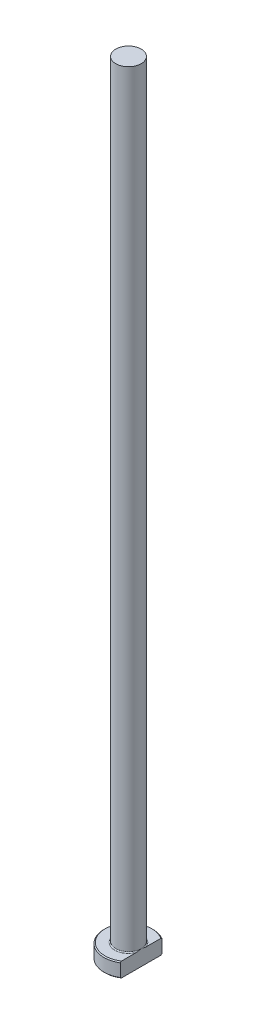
ISO-10303-21;
HEADER;
FILE_DESCRIPTION(('STEP AP214'),'2;1');
FILE_NAME('part.step','',(''),(''),'','','');
FILE_SCHEMA(('AUTOMOTIVE_DESIGN { 1 0 10303 214 1 1 1 1 }'));
ENDSEC;
DATA;
#1=APPLICATION_CONTEXT('core data for automotive mechanical design processes');
#2=APPLICATION_PROTOCOL_DEFINITION('international standard','automotive_design',2000,#1);
#3=PRODUCT_CONTEXT('',#1,'mechanical');
#4=PRODUCT('Part','Part','',(#3));
#5=PRODUCT_RELATED_PRODUCT_CATEGORY('part','',(#4));
#6=PRODUCT_DEFINITION_FORMATION('','',#4);
#7=PRODUCT_DEFINITION_CONTEXT('part definition',#1,'design');
#8=PRODUCT_DEFINITION('design','',#6,#7);
#9=PRODUCT_DEFINITION_SHAPE('','',#8);
#10=(LENGTH_UNIT() NAMED_UNIT(*) SI_UNIT(.MILLI.,.METRE.));
#11=(NAMED_UNIT(*) PLANE_ANGLE_UNIT() SI_UNIT($,.RADIAN.));
#12=(NAMED_UNIT(*) SI_UNIT($,.STERADIAN.) SOLID_ANGLE_UNIT());
#13=UNCERTAINTY_MEASURE_WITH_UNIT(LENGTH_MEASURE(1.E-05),#10,'distance_accuracy_value','');
#14=(GEOMETRIC_REPRESENTATION_CONTEXT(3) GLOBAL_UNCERTAINTY_ASSIGNED_CONTEXT((#13)) GLOBAL_UNIT_ASSIGNED_CONTEXT((#10,
#11,#12)) REPRESENTATION_CONTEXT('',''));
#15=CARTESIAN_POINT('',(0.,0.,0.));
#16=DIRECTION('',(0.,0.,1.));
#17=DIRECTION('',(1.,0.,0.));
#18=AXIS2_PLACEMENT_3D('',#15,#16,#17);
#19=CARTESIAN_POINT('',(0.,0.,0.));
#20=DIRECTION('',(0.,-1.,0.));
#21=DIRECTION('',(0.,0.,-1.));
#22=AXIS2_PLACEMENT_3D('',#19,#20,#21);
#23=PLANE('',#22);
#24=CARTESIAN_POINT('',(0.,0.,0.));
#25=DIRECTION('',(0.,-1.,0.));
#26=DIRECTION('',(0.,0.,-1.));
#27=AXIS2_PLACEMENT_3D('',#24,#25,#26);
#28=CIRCLE('',#27,4.79999999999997);
#29=CARTESIAN_POINT('',(2.59999999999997,0.,4.03484820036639));
#30=VERTEX_POINT('',#29);
#31=CARTESIAN_POINT('',(2.59999999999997,0.,-4.03484820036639));
#32=VERTEX_POINT('',#31);
#33=EDGE_CURVE('E98',#30,#32,#28,.T.);
#34=ORIENTED_EDGE('',*,*,#33,.T.);
#35=DIRECTION('',(0.,0.,1.));
#36=VECTOR('',#35,1.);
#37=CARTESIAN_POINT('',(2.59999999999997,0.,-4.27083130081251));
#38=LINE('',#37,#36);
#39=EDGE_CURVE('E83',#32,#30,#38,.T.);
#40=ORIENTED_EDGE('',*,*,#39,.T.);
#41=EDGE_LOOP('',(#34,#40));
#42=FACE_BOUND('',#41,.T.);
#43=ADVANCED_FACE('F32',(#42),#23,.T.);
#44=CARTESIAN_POINT('',(0.,259.958771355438,0.));
#45=DIRECTION('',(0.,1.,0.));
#46=DIRECTION('',(0.,0.,1.));
#47=AXIS2_PLACEMENT_3D('',#44,#45,#46);
#48=CYLINDRICAL_SURFACE('',#47,4.99999999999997);
#49=CARTESIAN_POINT('',(0.,2.80000000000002,0.));
#50=DIRECTION('',(0.,1.,0.));
#51=DIRECTION('',(0.,0.,1.));
#52=AXIS2_PLACEMENT_3D('',#49,#50,#51);
#53=CIRCLE('',#52,4.99999999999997);
#54=CARTESIAN_POINT('',(2.59999999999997,2.80000000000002,4.27083130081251));
#55=VERTEX_POINT('',#54);
#56=CARTESIAN_POINT('',(2.59999999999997,2.80000000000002,-4.27083130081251));
#57=VERTEX_POINT('',#56);
#58=EDGE_CURVE('E104',#55,#57,#53,.F.);
#59=ORIENTED_EDGE('',*,*,#58,.T.);
#60=DIRECTION('',(0.,-1.,0.));
#61=VECTOR('',#60,1.);
#62=CARTESIAN_POINT('',(2.59999999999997,160.,-4.27083130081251));
#63=LINE('',#62,#61);
#64=CARTESIAN_POINT('',(2.59999999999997,0.199999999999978,-4.27083130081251));
#65=VERTEX_POINT('',#64);
#66=EDGE_CURVE('E183',#57,#65,#63,.T.);
#67=ORIENTED_EDGE('',*,*,#66,.T.);
#68=CARTESIAN_POINT('',(0.,0.199999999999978,0.));
#69=DIRECTION('',(0.,-1.,0.));
#70=DIRECTION('',(0.,0.,-1.));
#71=AXIS2_PLACEMENT_3D('',#68,#69,#70);
#72=CIRCLE('',#71,4.99999999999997);
#73=CARTESIAN_POINT('',(2.59999999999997,0.199999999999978,4.27083130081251));
#74=VERTEX_POINT('',#73);
#75=EDGE_CURVE('E100',#65,#74,#72,.F.);
#76=ORIENTED_EDGE('',*,*,#75,.T.);
#77=DIRECTION('',(0.,-1.,0.));
#78=VECTOR('',#77,1.);
#79=CARTESIAN_POINT('',(2.59999999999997,160.,4.27083130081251));
#80=LINE('',#79,#78);
#81=EDGE_CURVE('E93',#55,#74,#80,.T.);
#82=ORIENTED_EDGE('',*,*,#81,.F.);
#83=EDGE_LOOP('',(#59,#67,#76,#82));
#84=FACE_BOUND('',#83,.T.);
#85=ADVANCED_FACE('F158',(#84),#48,.T.);
#86=CARTESIAN_POINT('',(-4.99999999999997,3.,0.));
#87=DIRECTION('',(0.,1.,0.));
#88=DIRECTION('',(0.,0.,1.));
#89=AXIS2_PLACEMENT_3D('',#86,#87,#88);
#90=PLANE('',#89);
#91=CARTESIAN_POINT('',(0.,3.,0.));
#92=DIRECTION('',(0.,1.,0.));
#93=DIRECTION('',(0.,0.,1.));
#94=AXIS2_PLACEMENT_3D('',#91,#92,#93);
#95=CIRCLE('',#94,4.80000000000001);
#96=CARTESIAN_POINT('',(2.59999999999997,3.,-4.03484820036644));
#97=VERTEX_POINT('',#96);
#98=CARTESIAN_POINT('',(2.59999999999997,3.,4.03484820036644));
#99=VERTEX_POINT('',#98);
#100=EDGE_CURVE('E178',#97,#99,#95,.T.);
#101=ORIENTED_EDGE('',*,*,#100,.T.);
#102=DIRECTION('',(0.,0.,-1.));
#103=VECTOR('',#102,1.);
#104=CARTESIAN_POINT('',(2.59999999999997,3.,0.));
#105=LINE('',#104,#103);
#106=CARTESIAN_POINT('',(2.59999999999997,2.99999999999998,1.03923048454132));
#107=VERTEX_POINT('',#106);
#108=EDGE_CURVE('E57',#99,#107,#105,.T.);
#109=ORIENTED_EDGE('',*,*,#108,.T.);
#110=CARTESIAN_POINT('',(0.,3.,0.));
#111=DIRECTION('',(0.,1.,0.));
#112=DIRECTION('',(0.,0.,1.));
#113=AXIS2_PLACEMENT_3D('',#110,#111,#112);
#114=CIRCLE('',#113,2.79999999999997);
#115=CARTESIAN_POINT('',(2.59999999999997,2.99999999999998,-1.03923048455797));
#116=VERTEX_POINT('',#115);
#117=EDGE_CURVE('E107',#107,#116,#114,.F.);
#118=ORIENTED_EDGE('',*,*,#117,.T.);
#119=EDGE_CURVE('E136',#116,#97,#105,.T.);
#120=ORIENTED_EDGE('',*,*,#119,.T.);
#121=EDGE_LOOP('',(#101,#109,#118,#120));
#122=FACE_BOUND('',#121,.T.);
#123=ADVANCED_FACE('F147',(#122),#90,.T.);
#124=CARTESIAN_POINT('',(0.,3.,0.));
#125=DIRECTION('',(0.,-1.,0.));
#126=DIRECTION('',(0.,0.,-1.));
#127=AXIS2_PLACEMENT_3D('',#124,#125,#126);
#128=CONICAL_SURFACE('',#127,4.80000000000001,0.785398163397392);
#129=ORIENTED_EDGE('',*,*,#58,.F.);
#130=CARTESIAN_POINT('',(2.59999999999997,-1.95047472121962,9.397433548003));
#131=CARTESIAN_POINT('',(2.59999999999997,-1.76015203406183,9.19995130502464));
#132=CARTESIAN_POINT('',(2.59999999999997,-1.57004107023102,9.00226440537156));
#133=CARTESIAN_POINT('',(2.59999999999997,-1.19035454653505,8.6063734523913));
#134=CARTESIAN_POINT('',(2.59999999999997,-1.00077899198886,8.40816939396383));
#135=CARTESIAN_POINT('',(2.59999999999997,-0.622208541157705,8.01106626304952));
#136=CARTESIAN_POINT('',(2.59999999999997,-0.433213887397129,7.81216695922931));
#137=CARTESIAN_POINT('',(2.59999999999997,-0.0560371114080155,7.41360059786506));
#138=CARTESIAN_POINT('',(2.59999999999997,0.132145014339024,7.21393354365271));
#139=CARTESIAN_POINT('',(2.59999999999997,0.504316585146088,6.81701377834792));
#140=CARTESIAN_POINT('',(2.59999999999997,0.68832319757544,6.61977717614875));
#141=CARTESIAN_POINT('',(2.59999999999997,1.05506202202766,6.22412305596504));
#142=CARTESIAN_POINT('',(2.59999999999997,1.23779424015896,6.0257055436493));
#143=CARTESIAN_POINT('',(2.59999999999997,1.60155525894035,5.62737135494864));
#144=CARTESIAN_POINT('',(2.59999999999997,1.78258432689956,5.42745492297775));
#145=CARTESIAN_POINT('',(2.59999999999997,2.14238277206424,5.02560172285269));
#146=CARTESIAN_POINT('',(2.59999999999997,2.32115220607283,4.82366500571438));
#147=CARTESIAN_POINT('',(2.59999999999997,2.62527031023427,4.47469662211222));
#148=CARTESIAN_POINT('',(2.59999999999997,2.75138938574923,4.3283372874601));
#149=CARTESIAN_POINT('',(2.59999999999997,3.00151582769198,4.03379615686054));
#150=CARTESIAN_POINT('',(2.59999999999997,3.12552298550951,3.88561418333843));
#151=CARTESIAN_POINT('',(2.59999999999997,3.37190002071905,3.58545728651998));
#152=CARTESIAN_POINT('',(2.59999999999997,3.49424212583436,3.43345946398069));
#153=CARTESIAN_POINT('',(2.59999999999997,3.73490070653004,3.12636139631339));
#154=CARTESIAN_POINT('',(2.59999999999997,3.85321820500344,2.97126195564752));
#155=CARTESIAN_POINT('',(2.59999999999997,4.08579009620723,2.65464223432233));
#156=CARTESIAN_POINT('',(2.59999999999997,4.19996477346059,2.49306256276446));
#157=CARTESIAN_POINT('',(2.59999999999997,4.36468341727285,2.2461359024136));
#158=CARTESIAN_POINT('',(2.59999999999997,4.41853818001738,2.16300143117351));
#159=CARTESIAN_POINT('',(2.59999999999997,4.52346182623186,1.99499855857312));
#160=CARTESIAN_POINT('',(2.59999999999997,4.57453099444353,1.91013033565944));
#161=CARTESIAN_POINT('',(2.59999999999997,4.67263274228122,1.73932569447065));
#162=CARTESIAN_POINT('',(2.59999999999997,4.71970407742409,1.65341183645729));
#163=CARTESIAN_POINT('',(2.59999999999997,4.80952240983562,1.4793650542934));
#164=CARTESIAN_POINT('',(2.59999999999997,4.85226857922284,1.39123170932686));
#165=CARTESIAN_POINT('',(2.59999999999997,4.97211006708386,1.12354274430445));
#166=CARTESIAN_POINT('',(2.59999999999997,5.04118725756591,0.940070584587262));
#167=CARTESIAN_POINT('',(2.59999999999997,5.11752261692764,0.665284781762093));
#168=CARTESIAN_POINT('',(2.59999999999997,5.13802992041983,0.577624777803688));
#169=CARTESIAN_POINT('',(2.59999999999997,5.17073291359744,0.400736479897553));
#170=CARTESIAN_POINT('',(2.59999999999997,5.18292955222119,0.311508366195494));
#171=CARTESIAN_POINT('',(2.59999999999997,5.19813789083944,0.132628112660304));
#172=CARTESIAN_POINT('',(2.59999999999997,5.20118701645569,0.0429792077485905));
#173=CARTESIAN_POINT('',(2.59999999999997,5.19797827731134,-0.136154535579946));
#174=CARTESIAN_POINT('',(2.59999999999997,5.19171987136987,-0.225639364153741));
#175=CARTESIAN_POINT('',(2.59999999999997,5.17043196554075,-0.402893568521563));
#176=CARTESIAN_POINT('',(2.59999999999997,5.15546490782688,-0.490670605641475));
#177=CARTESIAN_POINT('',(2.59999999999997,5.11776551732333,-0.664523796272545));
#178=CARTESIAN_POINT('',(2.59999999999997,5.09503206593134,-0.750599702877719));
#179=CARTESIAN_POINT('',(2.59999999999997,5.04281440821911,-0.921261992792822));
#180=CARTESIAN_POINT('',(2.59999999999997,5.01328729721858,-1.00583506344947));
#181=CARTESIAN_POINT('',(2.59999999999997,4.94875799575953,-1.17281894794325));
#182=CARTESIAN_POINT('',(2.59999999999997,4.91375683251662,-1.25523016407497));
#183=CARTESIAN_POINT('',(2.59999999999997,4.80599778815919,-1.49096020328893));
#184=CARTESIAN_POINT('',(2.59999999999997,4.72750956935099,-1.64165062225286));
#185=CARTESIAN_POINT('',(2.59999999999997,4.55999715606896,-1.93711610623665));
#186=CARTESIAN_POINT('',(2.59999999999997,4.47096030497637,-2.08188377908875));
#187=CARTESIAN_POINT('',(2.59999999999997,4.2854154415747,-2.36729512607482));
#188=CARTESIAN_POINT('',(2.59999999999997,4.18888021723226,-2.50792095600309));
#189=CARTESIAN_POINT('',(2.59999999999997,3.99085344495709,-2.78550445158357));
#190=CARTESIAN_POINT('',(2.59999999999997,3.88936425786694,-2.92246381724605));
#191=CARTESIAN_POINT('',(2.59999999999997,3.68147097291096,-3.19533708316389));
#192=CARTESIAN_POINT('',(2.59999999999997,3.57502092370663,-3.33121580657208));
#193=CARTESIAN_POINT('',(2.59999999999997,3.35937457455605,-3.60078977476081));
#194=CARTESIAN_POINT('',(2.59999999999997,3.25017800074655,-3.73448479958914));
#195=CARTESIAN_POINT('',(2.59999999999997,3.02996614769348,-3.9998356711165));
#196=CARTESIAN_POINT('',(2.59999999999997,2.91895572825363,-4.13149556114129));
#197=CARTESIAN_POINT('',(2.59999999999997,2.69532568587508,-4.39344289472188));
#198=CARTESIAN_POINT('',(2.59999999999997,2.5827060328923,-4.52373031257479));
#199=CARTESIAN_POINT('',(2.59999999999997,2.2882388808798,-4.86104966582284));
#200=CARTESIAN_POINT('',(2.59999999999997,2.1054031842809,-5.06721827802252));
#201=CARTESIAN_POINT('',(2.59999999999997,1.73743041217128,-5.47749422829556));
#202=CARTESIAN_POINT('',(2.59999999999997,1.55229327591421,-5.68160151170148));
#203=CARTESIAN_POINT('',(2.59999999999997,1.18015264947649,-6.08844300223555));
#204=CARTESIAN_POINT('',(2.59999999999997,0.993147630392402,-6.29117580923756));
#205=CARTESIAN_POINT('',(2.59999999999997,0.617846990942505,-6.69544313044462));
#206=CARTESIAN_POINT('',(2.59999999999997,0.429551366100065,-6.8969776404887));
#207=CARTESIAN_POINT('',(2.59999999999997,0.0594707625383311,-7.29110398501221));
#208=CARTESIAN_POINT('',(2.59999999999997,-0.122275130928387,-7.48373254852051));
#209=CARTESIAN_POINT('',(2.59999999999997,-0.486506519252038,-7.86829020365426));
#210=CARTESIAN_POINT('',(2.59999999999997,-0.668992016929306,-8.06021929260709));
#211=CARTESIAN_POINT('',(2.59999999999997,-1.03436396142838,-8.44329936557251));
#212=CARTESIAN_POINT('',(2.59999999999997,-1.21724976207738,-8.63445096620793));
#213=CARTESIAN_POINT('',(2.59999999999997,-1.58351605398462,-9.01627657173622));
#214=CARTESIAN_POINT('',(2.59999999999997,-1.7668965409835,-9.20695058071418));
#215=CARTESIAN_POINT('',(2.59999999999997,-1.95047472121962,-9.397433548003));
#216=B_SPLINE_CURVE_WITH_KNOTS('',3,(#130,#131,#132,#133,#134,#135,#136,#137,#138,#139,#140,
#141,#142,#143,#144,#145,#146,#147,#148,#149,#150,#151,#152,#153,#154,#155,#156,#157,#158,#159,
#160,#161,#162,#163,#164,#165,#166,#167,#168,#169,#170,#171,#172,#173,#174,#175,#176,#177,#178,
#179,#180,#181,#182,#183,#184,#185,#186,#187,#188,#189,#190,#191,#192,#193,#194,#195,#196,#197,
#198,#199,#200,#201,#202,#203,#204,#205,#206,#207,#208,#209,#210,#211,#212,#213,#214,#215),
.UNSPECIFIED.,.F.,.F.,(4,2,2,2,2,2,2,2,2,2,2,2,2,2,2,2,2,2,2,2,2,2,2,2,2,2,2,2,2,2,2,2,2,2,2,2,
2,2,2,2,2,2,4),(0.,0.822799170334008,1.6456064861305,2.46872021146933,3.29183036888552,
4.1010519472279,4.91026964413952,5.71935814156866,6.5284262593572,7.10801764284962,
7.68766594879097,8.27296873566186,8.85812163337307,9.4514382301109,9.74855643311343,
10.0456442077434,10.3394095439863,10.6332310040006,11.2186835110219,11.4884410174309,
11.7581677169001,12.0267893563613,12.2954266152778,12.5621610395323,12.828933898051,
13.0974401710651,13.3658961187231,13.874890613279,14.3845021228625,14.8960582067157,
15.4073728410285,15.9251595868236,16.4429981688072,16.9596236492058,17.4762587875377,
18.30291760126,19.129598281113,19.957022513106,20.7844496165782,21.5789508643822,
22.3734551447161,23.1671010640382,23.9607401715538),.UNSPECIFIED.);
#217=EDGE_CURVE('E135',#55,#99,#216,.T.);
#218=ORIENTED_EDGE('',*,*,#217,.T.);
#219=ORIENTED_EDGE('',*,*,#100,.F.);
#220=EDGE_CURVE('E127',#97,#57,#216,.T.);
#221=ORIENTED_EDGE('',*,*,#220,.T.);
#222=EDGE_LOOP('',(#129,#218,#219,#221));
#223=FACE_BOUND('',#222,.T.);
#224=ADVANCED_FACE('F143',(#223),#128,.T.);
#225=CARTESIAN_POINT('',(0.,0.199999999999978,0.));
#226=DIRECTION('',(0.,1.,0.));
#227=DIRECTION('',(0.,0.,1.));
#228=AXIS2_PLACEMENT_3D('',#225,#226,#227);
#229=CONICAL_SURFACE('',#228,4.99999999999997,0.785398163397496);
#230=ORIENTED_EDGE('',*,*,#75,.F.);
#231=CARTESIAN_POINT('',(2.59999999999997,4.95047472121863,-9.397433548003));
#232=CARTESIAN_POINT('',(2.59999999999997,4.7601520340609,-9.19995130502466));
#233=CARTESIAN_POINT('',(2.59999999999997,4.57004107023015,-9.0022644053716));
#234=CARTESIAN_POINT('',(2.59999999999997,4.1903545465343,-8.60637345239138));
#235=CARTESIAN_POINT('',(2.59999999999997,4.00077899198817,-8.40816939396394));
#236=CARTESIAN_POINT('',(2.59999999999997,3.62220854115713,-8.01106626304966));
#237=CARTESIAN_POINT('',(2.59999999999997,3.43321388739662,-7.81216695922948));
#238=CARTESIAN_POINT('',(2.59999999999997,3.05603711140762,-7.41360059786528));
#239=CARTESIAN_POINT('',(2.59999999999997,2.86785498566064,-7.21393354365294));
#240=CARTESIAN_POINT('',(2.59999999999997,2.49568341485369,-6.81701377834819));
#241=CARTESIAN_POINT('',(2.59999999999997,2.3116768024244,-6.61977717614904));
#242=CARTESIAN_POINT('',(2.59999999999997,1.94493797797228,-6.22412305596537));
#243=CARTESIAN_POINT('',(2.59999999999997,1.76220575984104,-6.02570554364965));
#244=CARTESIAN_POINT('',(2.59999999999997,1.39844474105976,-5.62737135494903));
#245=CARTESIAN_POINT('',(2.59999999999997,1.2174156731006,-5.42745492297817));
#246=CARTESIAN_POINT('',(2.59999999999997,0.857617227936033,-5.02560172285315));
#247=CARTESIAN_POINT('',(2.59999999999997,0.67884779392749,-4.82366500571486));
#248=CARTESIAN_POINT('',(2.59999999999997,0.374729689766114,-4.4746966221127));
#249=CARTESIAN_POINT('',(2.59999999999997,0.248610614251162,-4.32833728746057));
#250=CARTESIAN_POINT('',(2.59999999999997,-0.0015158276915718,-4.03379615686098));
#251=CARTESIAN_POINT('',(2.59999999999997,-0.125522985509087,-3.88561418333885));
#252=CARTESIAN_POINT('',(2.59999999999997,-0.371900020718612,-3.58545728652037));
#253=CARTESIAN_POINT('',(2.59999999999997,-0.494242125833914,-3.43345946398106));
#254=CARTESIAN_POINT('',(2.59999999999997,-0.734900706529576,-3.12636139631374));
#255=CARTESIAN_POINT('',(2.59999999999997,-0.853218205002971,-2.97126195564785));
#256=CARTESIAN_POINT('',(2.59999999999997,-1.08579009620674,-2.65464223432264));
#257=CARTESIAN_POINT('',(2.59999999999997,-1.19996477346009,-2.49306256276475));
#258=CARTESIAN_POINT('',(2.59999999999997,-1.36468341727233,-2.24613590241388));
#259=CARTESIAN_POINT('',(2.59999999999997,-1.41853818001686,-2.16300143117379));
#260=CARTESIAN_POINT('',(2.59999999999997,-1.52346182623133,-1.99499855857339));
#261=CARTESIAN_POINT('',(2.59999999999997,-1.574530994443,-1.9101303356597));
#262=CARTESIAN_POINT('',(2.59999999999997,-1.67263274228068,-1.7393256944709));
#263=CARTESIAN_POINT('',(2.59999999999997,-1.71970407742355,-1.65341183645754));
#264=CARTESIAN_POINT('',(2.59999999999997,-1.80952240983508,-1.47936505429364));
#265=CARTESIAN_POINT('',(2.59999999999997,-1.8522685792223,-1.3912317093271));
#266=CARTESIAN_POINT('',(2.59999999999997,-1.97211006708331,-1.12354274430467));
#267=CARTESIAN_POINT('',(2.59999999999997,-2.04118725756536,-0.940070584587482));
#268=CARTESIAN_POINT('',(2.59999999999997,-2.11752261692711,-0.665284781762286));
#269=CARTESIAN_POINT('',(2.59999999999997,-2.1380299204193,-0.577624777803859));
#270=CARTESIAN_POINT('',(2.59999999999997,-2.17073291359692,-0.400736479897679));
#271=CARTESIAN_POINT('',(2.59999999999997,-2.18292955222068,-0.311508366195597));
#272=CARTESIAN_POINT('',(2.59999999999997,-2.19813789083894,-0.132628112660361));
#273=CARTESIAN_POINT('',(2.59999999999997,-2.20118701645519,-0.0429792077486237));
#274=CARTESIAN_POINT('',(2.59999999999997,-2.19797827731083,0.136154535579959));
#275=CARTESIAN_POINT('',(2.59999999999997,-2.19171987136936,0.225639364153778));
#276=CARTESIAN_POINT('',(2.59999999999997,-2.17043196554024,0.402893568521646));
#277=CARTESIAN_POINT('',(2.59999999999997,-2.15546490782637,0.490670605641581));
#278=CARTESIAN_POINT('',(2.59999999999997,-2.11776551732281,0.664523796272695));
#279=CARTESIAN_POINT('',(2.59999999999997,-2.09503206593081,0.750599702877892));
#280=CARTESIAN_POINT('',(2.59999999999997,-2.04281440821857,0.921261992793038));
#281=CARTESIAN_POINT('',(2.59999999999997,-2.01328729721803,1.00583506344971));
#282=CARTESIAN_POINT('',(2.59999999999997,-1.94875799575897,1.17281894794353));
#283=CARTESIAN_POINT('',(2.59999999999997,-1.91375683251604,1.25523016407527));
#284=CARTESIAN_POINT('',(2.59999999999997,-1.80599778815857,1.49096020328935));
#285=CARTESIAN_POINT('',(2.59999999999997,-1.72750956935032,1.64165062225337));
#286=CARTESIAN_POINT('',(2.59999999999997,-1.55999715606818,1.93711610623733));
#287=CARTESIAN_POINT('',(2.59999999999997,-1.47096030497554,2.08188377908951));
#288=CARTESIAN_POINT('',(2.59999999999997,-1.28541544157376,2.36729512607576));
#289=CARTESIAN_POINT('',(2.59999999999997,-1.18888021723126,2.50792095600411));
#290=CARTESIAN_POINT('',(2.59999999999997,-0.990853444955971,2.78550445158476));
#291=CARTESIAN_POINT('',(2.59999999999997,-0.889364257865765,2.92246381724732));
#292=CARTESIAN_POINT('',(2.59999999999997,-0.681470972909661,3.19533708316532));
#293=CARTESIAN_POINT('',(2.59999999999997,-0.575020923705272,3.3312158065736));
#294=CARTESIAN_POINT('',(2.59999999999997,-0.359374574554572,3.60078977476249));
#295=CARTESIAN_POINT('',(2.59999999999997,-0.250178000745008,3.7344847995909));
#296=CARTESIAN_POINT('',(2.59999999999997,-0.0299661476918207,3.99983567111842));
#297=CARTESIAN_POINT('',(2.59999999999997,0.0810442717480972,4.13149556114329));
#298=CARTESIAN_POINT('',(2.59999999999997,0.304674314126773,4.39344289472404));
#299=CARTESIAN_POINT('',(2.59999999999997,0.41729396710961,4.52373031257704));
#300=CARTESIAN_POINT('',(2.59999999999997,0.711761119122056,4.86104966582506));
#301=CARTESIAN_POINT('',(2.59999999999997,0.894596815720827,5.06721827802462));
#302=CARTESIAN_POINT('',(2.59999999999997,1.2625695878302,5.47749422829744));
#303=CARTESIAN_POINT('',(2.59999999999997,1.44770672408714,5.68160151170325));
#304=CARTESIAN_POINT('',(2.59999999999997,1.81984735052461,6.08844300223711));
#305=CARTESIAN_POINT('',(2.59999999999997,2.00685236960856,6.29117580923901));
#306=CARTESIAN_POINT('',(2.59999999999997,2.3821530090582,6.69544313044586));
#307=CARTESIAN_POINT('',(2.59999999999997,2.57044863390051,6.89697764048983));
#308=CARTESIAN_POINT('',(2.59999999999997,2.94052923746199,7.29110398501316));
#309=CARTESIAN_POINT('',(2.59999999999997,3.12227513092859,7.48373254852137));
#310=CARTESIAN_POINT('',(2.59999999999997,3.48650651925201,7.86829020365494));
#311=CARTESIAN_POINT('',(2.59999999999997,3.66899201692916,8.06021929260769));
#312=CARTESIAN_POINT('',(2.59999999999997,4.03436396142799,8.44329936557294));
#313=CARTESIAN_POINT('',(2.59999999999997,4.21724976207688,8.63445096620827));
#314=CARTESIAN_POINT('',(2.59999999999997,4.58351605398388,9.01627657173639));
#315=CARTESIAN_POINT('',(2.59999999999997,4.76689654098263,9.20695058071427));
#316=CARTESIAN_POINT('',(2.59999999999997,4.95047472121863,9.397433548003));
#317=B_SPLINE_CURVE_WITH_KNOTS('',3,(#231,#232,#233,#234,#235,#236,#237,#238,#239,#240,#241,
#242,#243,#244,#245,#246,#247,#248,#249,#250,#251,#252,#253,#254,#255,#256,#257,#258,#259,#260,
#261,#262,#263,#264,#265,#266,#267,#268,#269,#270,#271,#272,#273,#274,#275,#276,#277,#278,#279,
#280,#281,#282,#283,#284,#285,#286,#287,#288,#289,#290,#291,#292,#293,#294,#295,#296,#297,#298,
#299,#300,#301,#302,#303,#304,#305,#306,#307,#308,#309,#310,#311,#312,#313,#314,#315,#316),
.UNSPECIFIED.,.F.,.F.,(4,2,2,2,2,2,2,2,2,2,2,2,2,2,2,2,2,2,2,2,2,2,2,2,2,2,2,2,2,2,2,2,2,2,2,2,
2,2,2,2,2,2,4),(0.,0.822799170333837,1.64560648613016,2.46872021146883,3.29183036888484,
4.10105194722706,4.91026964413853,5.71935814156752,6.5284262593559,7.10801764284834,
7.68766594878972,8.27296873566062,8.85812163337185,9.45143823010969,9.74855643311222,
10.0456442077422,10.3394095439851,10.6332310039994,11.2186835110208,11.4884410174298,
11.7581677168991,12.0267893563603,12.2954266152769,12.5621610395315,12.8289338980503,
13.0974401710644,13.3658961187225,13.8748906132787,14.3845021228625,14.896058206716,
15.4073728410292,15.9251595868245,16.4429981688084,16.9596236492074,17.4762587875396,
18.3029176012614,19.1295982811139,19.9570225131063,20.7844496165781,21.5789508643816,
22.3734551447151,23.1671010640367,23.9607401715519),.UNSPECIFIED.);
#318=EDGE_CURVE('E86',#65,#32,#317,.T.);
#319=ORIENTED_EDGE('',*,*,#318,.T.);
#320=ORIENTED_EDGE('',*,*,#33,.F.);
#321=EDGE_CURVE('E89',#30,#74,#317,.T.);
#322=ORIENTED_EDGE('',*,*,#321,.T.);
#323=EDGE_LOOP('',(#230,#319,#320,#322));
#324=FACE_BOUND('',#323,.T.);
#325=ADVANCED_FACE('F97',(#324),#229,.T.);
#326=CARTESIAN_POINT('',(0.,3.19999999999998,0.));
#327=DIRECTION('',(0.,1.,0.));
#328=DIRECTION('',(0.,0.,1.));
#329=AXIS2_PLACEMENT_3D('',#326,#327,#328);
#330=TOROIDAL_SURFACE('',#329,2.79999999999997,0.2);
#331=CARTESIAN_POINT('',(2.59999999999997,3.19999999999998,0.));
#332=CARTESIAN_POINT('',(2.59999999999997,3.20000050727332,1.23579409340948E-10));
#333=CARTESIAN_POINT('',(2.59999999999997,3.20000101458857,-1.74789552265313E-07));
#334=CARTESIAN_POINT('',(2.59999999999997,3.20000196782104,-6.73287793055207E-07));
#335=CARTESIAN_POINT('',(2.59999999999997,3.20000240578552,-1.00747163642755E-06));
#336=CARTESIAN_POINT('',(2.59999999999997,3.20000330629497,-1.80604944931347E-06));
#337=CARTESIAN_POINT('',(2.59999999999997,3.20000375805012,-2.28310921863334E-06));
#338=CARTESIAN_POINT('',(2.59999999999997,3.20000457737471,-3.28018171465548E-06));
#339=CARTESIAN_POINT('',(2.59999999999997,3.20000494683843,-3.79874305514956E-06));
#340=CARTESIAN_POINT('',(2.59999999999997,3.20000629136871,-5.77594334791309E-06));
#341=CARTESIAN_POINT('',(2.59999999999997,3.20000719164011,-7.28765589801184E-06));
#342=CARTESIAN_POINT('',(2.59999999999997,3.20000869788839,-1.03067582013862E-05));
#343=CARTESIAN_POINT('',(2.59999999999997,3.20000932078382,-1.18060929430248E-05));
#344=CARTESIAN_POINT('',(2.59999999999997,3.20001188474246,-1.80612988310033E-05));
#345=CARTESIAN_POINT('',(2.59999999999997,3.20001376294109,-2.28467812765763E-05));
#346=CARTESIAN_POINT('',(2.59999999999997,3.20001657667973,-3.19530305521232E-05));
#347=CARTESIAN_POINT('',(2.59999999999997,3.20001760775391,-3.62442681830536E-05));
#348=CARTESIAN_POINT('',(2.59999999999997,3.20002504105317,-6.7868346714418E-05));
#349=CARTESIAN_POINT('',(2.59999999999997,3.20003059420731,-9.53536176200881E-05));
#350=CARTESIAN_POINT('',(2.59999999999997,3.20005490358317,-0.000203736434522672));
#351=CARTESIAN_POINT('',(2.59999999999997,3.20007818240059,-0.000283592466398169));
#352=CARTESIAN_POINT('',(2.59999999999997,3.2001686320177,-0.000599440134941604));
#353=CARTESIAN_POINT('',(2.59999999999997,3.2002328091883,-0.000836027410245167));
#354=CARTESIAN_POINT('',(2.59999999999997,3.20048945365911,-0.00177477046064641));
#355=CARTESIAN_POINT('',(2.59999999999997,3.20068565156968,-0.00247616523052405));
#356=CARTESIAN_POINT('',(2.59999999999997,3.20149940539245,-0.0053934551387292));
#357=CARTESIAN_POINT('',(2.59999999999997,3.20211229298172,-0.007610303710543));
#358=CARTESIAN_POINT('',(2.59999999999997,3.2076646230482,-0.0276831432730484));
#359=CARTESIAN_POINT('',(2.59999999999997,3.21262302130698,-0.0455354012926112));
#360=CARTESIAN_POINT('',(2.59999999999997,3.22230897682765,-0.0805439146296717));
#361=CARTESIAN_POINT('',(2.59999999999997,3.22703791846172,-0.0976998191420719));
#362=CARTESIAN_POINT('',(2.59999999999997,3.23705035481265,-0.134181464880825));
#363=CARTESIAN_POINT('',(2.59999999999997,3.2423287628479,-0.153508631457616));
#364=CARTESIAN_POINT('',(2.59999999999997,3.25286316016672,-0.192393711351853));
#365=CARTESIAN_POINT('',(2.59999999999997,3.25811828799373,-0.211951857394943));
#366=CARTESIAN_POINT('',(2.59999999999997,3.27070509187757,-0.259316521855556));
#367=CARTESIAN_POINT('',(2.59999999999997,3.27798202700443,-0.287137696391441));
#368=CARTESIAN_POINT('',(2.59999999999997,3.29204094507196,-0.342105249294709));
#369=CARTESIAN_POINT('',(2.59999999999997,3.29883098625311,-0.36924957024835));
#370=CARTESIAN_POINT('',(2.59999999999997,3.32069835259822,-0.459246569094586));
#371=CARTESIAN_POINT('',(2.59999999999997,3.33498012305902,-0.522296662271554));
#372=CARTESIAN_POINT('',(2.59999999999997,3.36056532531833,-0.649787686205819));
#373=CARTESIAN_POINT('',(2.59999999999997,3.37183254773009,-0.714236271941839));
#374=CARTESIAN_POINT('',(2.59999999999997,3.38542084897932,-0.81395858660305));
#375=CARTESIAN_POINT('',(2.59999999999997,3.38947199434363,-0.84899397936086));
#376=CARTESIAN_POINT('',(2.59999999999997,3.39578733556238,-0.91922149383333));
#377=CARTESIAN_POINT('',(2.59999999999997,3.39805216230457,-0.954413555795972));
#378=CARTESIAN_POINT('',(2.59999999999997,3.40031330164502,-1.02465521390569));
#379=CARTESIAN_POINT('',(2.59999999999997,3.40032384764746,-1.05970430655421));
#380=CARTESIAN_POINT('',(2.59999999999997,3.39745377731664,-1.1296713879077));
#381=CARTESIAN_POINT('',(2.59999999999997,3.39457726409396,-1.16458949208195));
#382=CARTESIAN_POINT('',(2.59999999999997,3.38762659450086,-1.21434358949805));
#383=CARTESIAN_POINT('',(2.59999999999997,3.3851418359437,-1.22940327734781));
#384=CARTESIAN_POINT('',(2.59999999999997,3.37928992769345,-1.25936829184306));
#385=CARTESIAN_POINT('',(2.59999999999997,3.37592199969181,-1.27427347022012));
#386=CARTESIAN_POINT('',(2.59999999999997,3.36819593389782,-1.30360801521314));
#387=CARTESIAN_POINT('',(2.59999999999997,3.36385215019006,-1.31804111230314));
#388=CARTESIAN_POINT('',(2.59999999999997,3.35394180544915,-1.34647366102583));
#389=CARTESIAN_POINT('',(2.59999999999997,3.34837682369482,-1.36047364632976));
#390=CARTESIAN_POINT('',(2.59999999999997,3.3378467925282,-1.3832098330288));
#391=CARTESIAN_POINT('',(2.59999999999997,3.33330355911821,-1.39214053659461));
#392=CARTESIAN_POINT('',(2.59999999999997,3.32341812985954,-1.40958482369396));
#393=CARTESIAN_POINT('',(2.59999999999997,3.31807401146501,-1.41809733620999));
#394=CARTESIAN_POINT('',(2.59999999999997,3.3064185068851,-1.43453575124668));
#395=CARTESIAN_POINT('',(2.59999999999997,3.30010038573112,-1.44245695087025));
#396=CARTESIAN_POINT('',(2.59999999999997,3.28637957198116,-1.45729976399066));
#397=CARTESIAN_POINT('',(2.59999999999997,3.27897945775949,-1.46422367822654));
#398=CARTESIAN_POINT('',(2.59999999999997,3.26567821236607,-1.47448129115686));
#399=CARTESIAN_POINT('',(2.59999999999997,3.26010727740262,-1.47824010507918));
#400=CARTESIAN_POINT('',(2.59999999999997,3.24845655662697,-1.48487520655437));
#401=CARTESIAN_POINT('',(2.59999999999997,3.24237710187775,-1.4877520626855));
#402=CARTESIAN_POINT('',(2.59999999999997,3.22972757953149,-1.49241784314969));
#403=CARTESIAN_POINT('',(2.59999999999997,3.22315282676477,-1.49419437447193));
#404=CARTESIAN_POINT('',(2.59999999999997,3.20978231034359,-1.49640812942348));
#405=CARTESIAN_POINT('',(2.59999999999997,3.20298682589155,-1.49684698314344));
#406=CARTESIAN_POINT('',(2.59999999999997,3.19037691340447,-1.49637060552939));
#407=CARTESIAN_POINT('',(2.59999999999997,3.18455503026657,-1.49563180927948));
#408=CARTESIAN_POINT('',(2.59999999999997,3.17311801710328,-1.49319000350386));
#409=CARTESIAN_POINT('',(2.59999999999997,3.1675030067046,-1.49148644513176));
#410=CARTESIAN_POINT('',(2.59999999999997,3.15514195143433,-1.48668054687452));
#411=CARTESIAN_POINT('',(2.59999999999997,3.14849468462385,-1.48332605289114));
#412=CARTESIAN_POINT('',(2.59999999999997,3.13582833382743,-1.47559145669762));
#413=CARTESIAN_POINT('',(2.59999999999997,3.12981053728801,-1.47120930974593));
#414=CARTESIAN_POINT('',(2.59999999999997,3.11535552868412,-1.45914343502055));
#415=CARTESIAN_POINT('',(2.59999999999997,3.10734855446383,-1.45094839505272));
#416=CARTESIAN_POINT('',(2.59999999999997,3.09265977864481,-1.43346680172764));
#417=CARTESIAN_POINT('',(2.59999999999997,3.08598026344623,-1.4241784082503));
#418=CARTESIAN_POINT('',(2.59999999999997,3.06857102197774,-1.39681642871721));
#419=CARTESIAN_POINT('',(2.59999999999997,3.05915220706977,-1.37791719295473));
#420=CARTESIAN_POINT('',(2.59999999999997,3.04297062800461,-1.3389290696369));
#421=CARTESIAN_POINT('',(2.59999999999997,3.03622846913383,-1.31883227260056));
#422=CARTESIAN_POINT('',(2.59999999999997,3.02432998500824,-1.27632728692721));
#423=CARTESIAN_POINT('',(2.59999999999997,3.01935848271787,-1.25386836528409));
#424=CARTESIAN_POINT('',(2.59999999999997,3.01130018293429,-1.20858750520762));
#425=CARTESIAN_POINT('',(2.59999999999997,3.00821705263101,-1.18576494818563));
#426=CARTESIAN_POINT('',(2.59999999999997,3.00363796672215,-1.1405967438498));
#427=CARTESIAN_POINT('',(2.59999999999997,3.00210096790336,-1.11825509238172));
#428=CARTESIAN_POINT('',(2.59999999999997,3.00022491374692,-1.07361049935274));
#429=CARTESIAN_POINT('',(2.59999999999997,2.99988136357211,-1.05130772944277));
#430=CARTESIAN_POINT('',(2.59999999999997,3.00029323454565,-0.991792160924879));
#431=CARTESIAN_POINT('',(2.59999999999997,3.00193756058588,-0.954585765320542));
#432=CARTESIAN_POINT('',(2.59999999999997,3.00736147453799,-0.880345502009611));
#433=CARTESIAN_POINT('',(2.59999999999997,3.01114096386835,-0.843311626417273));
#434=CARTESIAN_POINT('',(2.59999999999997,3.02049059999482,-0.768589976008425));
#435=CARTESIAN_POINT('',(2.59999999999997,3.02610078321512,-0.730907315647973));
#436=CARTESIAN_POINT('',(2.59999999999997,3.0387231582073,-0.655686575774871));
#437=CARTESIAN_POINT('',(2.59999999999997,3.0457387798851,-0.618149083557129));
#438=CARTESIAN_POINT('',(2.59999999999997,3.06358120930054,-0.52980872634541));
#439=CARTESIAN_POINT('',(2.59999999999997,3.07487037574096,-0.479100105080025));
#440=CARTESIAN_POINT('',(2.59999999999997,3.09870164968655,-0.378576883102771));
#441=CARTESIAN_POINT('',(2.59999999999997,3.1112285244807,-0.328758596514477));
#442=CARTESIAN_POINT('',(2.59999999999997,3.13564556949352,-0.234990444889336));
#443=CARTESIAN_POINT('',(2.59999999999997,3.14744634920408,-0.191016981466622));
#444=CARTESIAN_POINT('',(2.59999999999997,3.17192746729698,-0.101304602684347));
#445=CARTESIAN_POINT('',(2.59999999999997,3.18462387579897,-0.0555700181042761));
#446=CARTESIAN_POINT('',(2.59999999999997,3.19788889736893,-0.00760560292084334));
#447=CARTESIAN_POINT('',(2.59999999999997,3.19850316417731,-0.00538409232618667));
#448=CARTESIAN_POINT('',(2.59999999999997,3.19931724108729,-0.00246573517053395));
#449=CARTESIAN_POINT('',(2.59999999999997,3.19951242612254,-0.00176794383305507));
#450=CARTESIAN_POINT('',(2.59999999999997,3.19976783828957,-0.000833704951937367));
#451=CARTESIAN_POINT('',(2.59999999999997,3.19983177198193,-0.000598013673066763));
#452=CARTESIAN_POINT('',(2.59999999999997,3.19992192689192,-0.000283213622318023));
#453=CARTESIAN_POINT('',(2.59999999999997,3.19994516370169,-0.00020351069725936));
#454=CARTESIAN_POINT('',(2.59999999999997,3.19996943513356,-9.53048357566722E-05));
#455=CARTESIAN_POINT('',(2.59999999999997,3.19997498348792,-6.78414250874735E-05));
#456=CARTESIAN_POINT('',(2.59999999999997,3.1999824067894,-3.62395621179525E-05));
#457=CARTESIAN_POINT('',(2.59999999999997,3.19998343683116,-3.19495761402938E-05));
#458=CARTESIAN_POINT('',(2.59999999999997,3.19998624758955,-2.2845859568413E-05));
#459=CARTESIAN_POINT('',(2.59999999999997,3.19998812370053,-1.80615919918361E-05));
#460=CARTESIAN_POINT('',(2.59999999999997,3.19999068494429,-1.18076342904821E-05));
#461=CARTESIAN_POINT('',(2.59999999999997,3.19999130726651,-1.03083932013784E-05));
#462=CARTESIAN_POINT('',(2.59999999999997,3.19999281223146,-7.28938063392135E-06));
#463=CARTESIAN_POINT('',(2.59999999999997,3.19999371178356,-5.77765312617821E-06));
#464=CARTESIAN_POINT('',(2.59999999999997,3.19999505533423,-3.80031827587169E-06));
#465=CARTESIAN_POINT('',(2.59999999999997,3.19999542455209,-3.28169096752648E-06));
#466=CARTESIAN_POINT('',(2.59999999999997,3.19999624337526,-2.28444217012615E-06));
#467=CARTESIAN_POINT('',(2.59999999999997,3.19999669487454,-1.80727069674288E-06));
#468=CARTESIAN_POINT('',(2.59999999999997,3.19999759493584,-1.00842880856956E-06));
#469=CARTESIAN_POINT('',(2.59999999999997,3.19999803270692,-6.74101888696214E-07));
#470=CARTESIAN_POINT('',(2.59999999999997,3.19999898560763,-1.75245051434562E-07));
#471=CARTESIAN_POINT('',(2.59999999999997,3.19999949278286,-1.23565714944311E-10));
#472=CARTESIAN_POINT('',(2.59999999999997,3.19999999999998,0.));
#473=B_SPLINE_CURVE_WITH_KNOTS('',3,(#331,#332,#333,#334,#335,#336,#337,#338,#339,#340,#341,
#342,#343,#344,#345,#346,#347,#348,#349,#350,#351,#352,#353,#354,#355,#356,#357,#358,#359,#360,
#361,#362,#363,#364,#365,#366,#367,#368,#369,#370,#371,#372,#373,#374,#375,#376,#377,#378,#379,
#380,#381,#382,#383,#384,#385,#386,#387,#388,#389,#390,#391,#392,#393,#394,#395,#396,#397,#398,
#399,#400,#401,#402,#403,#404,#405,#406,#407,#408,#409,#410,#411,#412,#413,#414,#415,#416,#417,
#418,#419,#420,#421,#422,#423,#424,#425,#426,#427,#428,#429,#430,#431,#432,#433,#434,#435,#436,
#437,#438,#439,#440,#441,#442,#443,#444,#445,#446,#447,#448,#449,#450,#451,#452,#453,#454,#455,
#456,#457,#458,#459,#460,#461,#462,#463,#464,#465,#466,#467,#468,#469,#470,#471,#472),
.UNSPECIFIED.,.T.,.F.,(4,2,2,2,2,2,2,2,2,2,2,2,2,2,2,2,2,2,2,2,2,2,2,2,2,2,2,2,2,2,2,2,2,2,2,2,
2,2,2,2,2,2,2,2,2,2,2,2,2,2,2,2,2,2,2,2,2,2,2,2,2,2,2,2,2,2,2,2,2,2,4),(0.,1.53042757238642E-06,
3.18106748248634E-06,5.14121990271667E-06,7.05005828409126E-06,1.23079983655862E-05,
1.7174539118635E-05,3.25667081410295E-05,4.57900795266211E-05,0.00012992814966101,
0.00037919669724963,0.00111488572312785,0.00329950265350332,0.0101999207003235,
0.0657821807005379,0.119169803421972,0.179274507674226,0.24002995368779,0.326299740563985,
0.410240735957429,0.6041400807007,0.800273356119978,0.906045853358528,1.01178097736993,
1.1168484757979,1.22176686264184,1.26753679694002,1.31334720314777,1.35852340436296,
1.40364152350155,1.43367014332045,1.46377203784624,1.49409227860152,1.52434140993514,
1.54444068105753,1.56452696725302,1.58483555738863,1.6051193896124,1.62263810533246,
1.64016679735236,1.66238011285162,1.6846380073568,1.71881594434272,1.75305224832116,
1.81604715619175,1.87951801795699,1.94841441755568,2.01744419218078,2.08458891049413,
2.15148046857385,2.26311962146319,2.37475362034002,2.48901400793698,2.60355671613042,
2.75937570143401,2.91347192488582,3.0500585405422,3.19244561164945,3.19936059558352,
3.20153398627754,3.20226688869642,3.20251568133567,3.2025997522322,3.20261297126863,
3.20262835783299,3.20263322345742,3.20263848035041,3.20264038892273,3.2026423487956,
3.20264399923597,3.20264552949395),.UNSPECIFIED.);
#474=CARTESIAN_POINT('',(2.59999999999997,3.19999999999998,0.));
#475=VERTEX_POINT('',#474);
#476=EDGE_CURVE('E11',#116,#475,#473,.T.);
#477=ORIENTED_EDGE('',*,*,#476,.F.);
#478=ORIENTED_EDGE('',*,*,#117,.F.);
#479=CARTESIAN_POINT('',(2.59999999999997,3.19999999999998,0.));
#480=CARTESIAN_POINT('',(2.59999999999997,3.19999949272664,-1.23579435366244E-10));
#481=CARTESIAN_POINT('',(2.59999999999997,3.19999898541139,1.74789552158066E-07));
#482=CARTESIAN_POINT('',(2.59999999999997,3.19999803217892,6.73287792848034E-07));
#483=CARTESIAN_POINT('',(2.59999999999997,3.19999759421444,1.00747163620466E-06));
#484=CARTESIAN_POINT('',(2.59999999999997,3.19999669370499,1.80604944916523E-06));
#485=CARTESIAN_POINT('',(2.59999999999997,3.19999624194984,2.28310921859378E-06));
#486=CARTESIAN_POINT('',(2.59999999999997,3.19999542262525,3.28018171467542E-06));
#487=CARTESIAN_POINT('',(2.59999999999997,3.19999505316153,3.79874305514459E-06));
#488=CARTESIAN_POINT('',(2.59999999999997,3.19999370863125,5.77594334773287E-06));
#489=CARTESIAN_POINT('',(2.59999999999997,3.19999280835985,7.28765589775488E-06));
#490=CARTESIAN_POINT('',(2.59999999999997,3.19999130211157,1.03067582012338E-05));
#491=CARTESIAN_POINT('',(2.59999999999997,3.19999067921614,1.18060929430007E-05));
#492=CARTESIAN_POINT('',(2.59999999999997,3.1999881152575,1.80612988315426E-05));
#493=CARTESIAN_POINT('',(2.59999999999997,3.19998623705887,2.28467812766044E-05));
#494=CARTESIAN_POINT('',(2.59999999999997,3.19998342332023,3.19530305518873E-05));
#495=CARTESIAN_POINT('',(2.59999999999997,3.19998239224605,3.62442681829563E-05));
#496=CARTESIAN_POINT('',(2.59999999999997,3.19997495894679,6.78683467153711E-05));
#497=CARTESIAN_POINT('',(2.59999999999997,3.19996940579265,9.53536176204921E-05));
#498=CARTESIAN_POINT('',(2.59999999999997,3.19994509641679,0.000203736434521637));
#499=CARTESIAN_POINT('',(2.59999999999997,3.19992181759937,0.000283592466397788));
#500=CARTESIAN_POINT('',(2.59999999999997,3.19983136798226,0.000599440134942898));
#501=CARTESIAN_POINT('',(2.59999999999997,3.19976719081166,0.000836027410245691));
#502=CARTESIAN_POINT('',(2.59999999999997,3.19951054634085,0.00177477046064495));
#503=CARTESIAN_POINT('',(2.59999999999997,3.19931434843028,0.00247616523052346));
#504=CARTESIAN_POINT('',(2.59999999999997,3.19850059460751,0.00539345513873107));
#505=CARTESIAN_POINT('',(2.59999999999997,3.19788770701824,0.00761030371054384));
#506=CARTESIAN_POINT('',(2.59999999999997,3.19233537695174,0.0276831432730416));
#507=CARTESIAN_POINT('',(2.59999999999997,3.18737697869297,0.0455354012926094));
#508=CARTESIAN_POINT('',(2.59999999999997,3.17769102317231,0.0805439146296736));
#509=CARTESIAN_POINT('',(2.59999999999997,3.17296208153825,0.0976998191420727));
#510=CARTESIAN_POINT('',(2.59999999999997,3.16294964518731,0.134181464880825));
#511=CARTESIAN_POINT('',(2.59999999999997,3.15767123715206,0.153508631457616));
#512=CARTESIAN_POINT('',(2.59999999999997,3.14713683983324,0.192393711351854));
#513=CARTESIAN_POINT('',(2.59999999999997,3.14188171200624,0.211951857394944));
#514=CARTESIAN_POINT('',(2.59999999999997,3.12929490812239,0.259316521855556));
#515=CARTESIAN_POINT('',(2.59999999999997,3.12201797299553,0.287137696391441));
#516=CARTESIAN_POINT('',(2.59999999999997,3.107959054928,0.342105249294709));
#517=CARTESIAN_POINT('',(2.59999999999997,3.10116901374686,0.36924957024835));
#518=CARTESIAN_POINT('',(2.59999999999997,3.07930164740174,0.459246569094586));
#519=CARTESIAN_POINT('',(2.59999999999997,3.06501987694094,0.522296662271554));
#520=CARTESIAN_POINT('',(2.59999999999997,3.03943467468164,0.649787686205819));
#521=CARTESIAN_POINT('',(2.59999999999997,3.02816745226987,0.714236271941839));
#522=CARTESIAN_POINT('',(2.59999999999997,3.01457915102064,0.81395858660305));
#523=CARTESIAN_POINT('',(2.59999999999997,3.01052800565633,0.84899397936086));
#524=CARTESIAN_POINT('',(2.59999999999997,3.00421266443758,0.91922149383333));
#525=CARTESIAN_POINT('',(2.59999999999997,3.00194783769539,0.954413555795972));
#526=CARTESIAN_POINT('',(2.59999999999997,2.99968669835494,1.02465521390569));
#527=CARTESIAN_POINT('',(2.59999999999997,2.9996761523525,1.05970430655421));
#528=CARTESIAN_POINT('',(2.59999999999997,3.00254622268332,1.1296713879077));
#529=CARTESIAN_POINT('',(2.59999999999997,3.005422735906,1.16458949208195));
#530=CARTESIAN_POINT('',(2.59999999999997,3.0123734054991,1.21434358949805));
#531=CARTESIAN_POINT('',(2.59999999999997,3.01485816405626,1.22940327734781));
#532=CARTESIAN_POINT('',(2.59999999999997,3.02071007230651,1.25936829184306));
#533=CARTESIAN_POINT('',(2.59999999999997,3.02407800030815,1.27427347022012));
#534=CARTESIAN_POINT('',(2.59999999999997,3.03180406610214,1.30360801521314));
#535=CARTESIAN_POINT('',(2.59999999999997,3.0361478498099,1.31804111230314));
#536=CARTESIAN_POINT('',(2.59999999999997,3.04605819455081,1.34647366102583));
#537=CARTESIAN_POINT('',(2.59999999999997,3.05162317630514,1.36047364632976));
#538=CARTESIAN_POINT('',(2.59999999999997,3.06215320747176,1.3832098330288));
#539=CARTESIAN_POINT('',(2.59999999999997,3.06669644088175,1.39214053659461));
#540=CARTESIAN_POINT('',(2.59999999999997,3.07658187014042,1.40958482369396));
#541=CARTESIAN_POINT('',(2.59999999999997,3.08192598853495,1.41809733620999));
#542=CARTESIAN_POINT('',(2.59999999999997,3.09358149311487,1.43453575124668));
#543=CARTESIAN_POINT('',(2.59999999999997,3.09989961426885,1.44245695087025));
#544=CARTESIAN_POINT('',(2.59999999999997,3.11362042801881,1.45729976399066));
#545=CARTESIAN_POINT('',(2.59999999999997,3.12102054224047,1.46422367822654));
#546=CARTESIAN_POINT('',(2.59999999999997,3.13432178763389,1.47448129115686));
#547=CARTESIAN_POINT('',(2.59999999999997,3.13989272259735,1.47824010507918));
#548=CARTESIAN_POINT('',(2.59999999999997,3.15154344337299,1.48487520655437));
#549=CARTESIAN_POINT('',(2.59999999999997,3.15762289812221,1.4877520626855));
#550=CARTESIAN_POINT('',(2.59999999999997,3.17027242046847,1.49241784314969));
#551=CARTESIAN_POINT('',(2.59999999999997,3.17684717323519,1.49419437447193));
#552=CARTESIAN_POINT('',(2.59999999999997,3.19021768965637,1.49640812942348));
#553=CARTESIAN_POINT('',(2.59999999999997,3.19701317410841,1.49684698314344));
#554=CARTESIAN_POINT('',(2.59999999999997,3.20962308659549,1.49637060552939));
#555=CARTESIAN_POINT('',(2.59999999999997,3.21544496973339,1.49563180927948));
#556=CARTESIAN_POINT('',(2.59999999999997,3.22688198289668,1.49319000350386));
#557=CARTESIAN_POINT('',(2.59999999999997,3.23249699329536,1.49148644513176));
#558=CARTESIAN_POINT('',(2.59999999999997,3.24485804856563,1.48668054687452));
#559=CARTESIAN_POINT('',(2.59999999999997,3.25150531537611,1.48332605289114));
#560=CARTESIAN_POINT('',(2.59999999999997,3.26417166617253,1.47559145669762));
#561=CARTESIAN_POINT('',(2.59999999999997,3.27018946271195,1.47120930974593));
#562=CARTESIAN_POINT('',(2.59999999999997,3.28464447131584,1.45914343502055));
#563=CARTESIAN_POINT('',(2.59999999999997,3.29265144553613,1.45094839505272));
#564=CARTESIAN_POINT('',(2.59999999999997,3.30734022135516,1.43346680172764));
#565=CARTESIAN_POINT('',(2.59999999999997,3.31401973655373,1.4241784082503));
#566=CARTESIAN_POINT('',(2.59999999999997,3.33142897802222,1.39681642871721));
#567=CARTESIAN_POINT('',(2.59999999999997,3.34084779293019,1.37791719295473));
#568=CARTESIAN_POINT('',(2.59999999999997,3.35702937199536,1.3389290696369));
#569=CARTESIAN_POINT('',(2.59999999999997,3.36377153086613,1.31883227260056));
#570=CARTESIAN_POINT('',(2.59999999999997,3.37567001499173,1.27632728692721));
#571=CARTESIAN_POINT('',(2.59999999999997,3.38064151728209,1.25386836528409));
#572=CARTESIAN_POINT('',(2.59999999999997,3.38869981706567,1.20858750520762));
#573=CARTESIAN_POINT('',(2.59999999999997,3.39178294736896,1.18576494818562));
#574=CARTESIAN_POINT('',(2.59999999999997,3.39636203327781,1.1405967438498));
#575=CARTESIAN_POINT('',(2.59999999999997,3.39789903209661,1.11825509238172));
#576=CARTESIAN_POINT('',(2.59999999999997,3.39977508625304,1.07361049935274));
#577=CARTESIAN_POINT('',(2.59999999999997,3.40011863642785,1.05130772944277));
#578=CARTESIAN_POINT('',(2.59999999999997,3.39970676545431,0.991792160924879));
#579=CARTESIAN_POINT('',(2.59999999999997,3.39806243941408,0.954585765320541));
#580=CARTESIAN_POINT('',(2.59999999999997,3.39263852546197,0.880345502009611));
#581=CARTESIAN_POINT('',(2.59999999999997,3.38885903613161,0.843311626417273));
#582=CARTESIAN_POINT('',(2.59999999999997,3.37950940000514,0.768589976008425));
#583=CARTESIAN_POINT('',(2.59999999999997,3.37389921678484,0.730907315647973));
#584=CARTESIAN_POINT('',(2.59999999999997,3.36127684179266,0.655686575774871));
#585=CARTESIAN_POINT('',(2.59999999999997,3.35426122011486,0.618149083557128));
#586=CARTESIAN_POINT('',(2.59999999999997,3.33641879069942,0.52980872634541));
#587=CARTESIAN_POINT('',(2.59999999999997,3.325129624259,0.479100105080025));
#588=CARTESIAN_POINT('',(2.59999999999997,3.30129835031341,0.378576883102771));
#589=CARTESIAN_POINT('',(2.59999999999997,3.28877147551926,0.328758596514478));
#590=CARTESIAN_POINT('',(2.59999999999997,3.26435443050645,0.234990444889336));
#591=CARTESIAN_POINT('',(2.59999999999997,3.25255365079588,0.19101698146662));
#592=CARTESIAN_POINT('',(2.59999999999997,3.22807253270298,0.101304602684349));
#593=CARTESIAN_POINT('',(2.59999999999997,3.21537612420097,0.0555700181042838));
#594=CARTESIAN_POINT('',(2.59999999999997,3.20211110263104,0.007605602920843));
#595=CARTESIAN_POINT('',(2.59999999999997,3.20149683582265,0.00538409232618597));
#596=CARTESIAN_POINT('',(2.59999999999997,3.20068275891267,0.00246573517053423));
#597=CARTESIAN_POINT('',(2.59999999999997,3.20048757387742,0.00176794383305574));
#598=CARTESIAN_POINT('',(2.59999999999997,3.20023216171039,0.000833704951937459));
#599=CARTESIAN_POINT('',(2.59999999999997,3.20016822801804,0.000598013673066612));
#600=CARTESIAN_POINT('',(2.59999999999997,3.20007807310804,0.000283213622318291));
#601=CARTESIAN_POINT('',(2.59999999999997,3.20005483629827,0.000203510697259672));
#602=CARTESIAN_POINT('',(2.59999999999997,3.20003056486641,9.53048357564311E-05));
#603=CARTESIAN_POINT('',(2.59999999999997,3.20002501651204,6.78414250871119E-05));
#604=CARTESIAN_POINT('',(2.59999999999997,3.20001759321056,3.62395621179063E-05));
#605=CARTESIAN_POINT('',(2.59999999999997,3.2000165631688,3.19495761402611E-05));
#606=CARTESIAN_POINT('',(2.59999999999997,3.20001375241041,2.28458595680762E-05));
#607=CARTESIAN_POINT('',(2.59999999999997,3.20001187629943,1.80615919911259E-05));
#608=CARTESIAN_POINT('',(2.59999999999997,3.20000931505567,1.18076342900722E-05));
#609=CARTESIAN_POINT('',(2.59999999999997,3.20000869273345,1.03083932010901E-05));
#610=CARTESIAN_POINT('',(2.59999999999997,3.2000071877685,7.28938063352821E-06));
#611=CARTESIAN_POINT('',(2.59999999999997,3.2000062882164,5.77765312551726E-06));
#612=CARTESIAN_POINT('',(2.59999999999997,3.20000494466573,3.80031827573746E-06));
#613=CARTESIAN_POINT('',(2.59999999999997,3.20000457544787,3.28169096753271E-06));
#614=CARTESIAN_POINT('',(2.59999999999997,3.2000037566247,2.28444217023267E-06));
#615=CARTESIAN_POINT('',(2.59999999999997,3.20000330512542,1.80727069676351E-06));
#616=CARTESIAN_POINT('',(2.59999999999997,3.20000240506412,1.00842880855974E-06));
#617=CARTESIAN_POINT('',(2.59999999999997,3.20000196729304,6.7410188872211E-07));
#618=CARTESIAN_POINT('',(2.59999999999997,3.20000101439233,1.75245051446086E-07));
#619=CARTESIAN_POINT('',(2.59999999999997,3.20000050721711,1.23565740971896E-10));
#620=CARTESIAN_POINT('',(2.59999999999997,3.19999999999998,0.));
#621=B_SPLINE_CURVE_WITH_KNOTS('',3,(#479,#480,#481,#482,#483,#484,#485,#486,#487,#488,#489,
#490,#491,#492,#493,#494,#495,#496,#497,#498,#499,#500,#501,#502,#503,#504,#505,#506,#507,#508,
#509,#510,#511,#512,#513,#514,#515,#516,#517,#518,#519,#520,#521,#522,#523,#524,#525,#526,#527,
#528,#529,#530,#531,#532,#533,#534,#535,#536,#537,#538,#539,#540,#541,#542,#543,#544,#545,#546,
#547,#548,#549,#550,#551,#552,#553,#554,#555,#556,#557,#558,#559,#560,#561,#562,#563,#564,#565,
#566,#567,#568,#569,#570,#571,#572,#573,#574,#575,#576,#577,#578,#579,#580,#581,#582,#583,#584,
#585,#586,#587,#588,#589,#590,#591,#592,#593,#594,#595,#596,#597,#598,#599,#600,#601,#602,#603,
#604,#605,#606,#607,#608,#609,#610,#611,#612,#613,#614,#615,#616,#617,#618,#619,#620),
.UNSPECIFIED.,.T.,.F.,(4,2,2,2,2,2,2,2,2,2,2,2,2,2,2,2,2,2,2,2,2,2,2,2,2,2,2,2,2,2,2,2,2,2,2,2,
2,2,2,2,2,2,2,2,2,2,2,2,2,2,2,2,2,2,2,2,2,2,2,2,2,2,2,2,2,2,2,2,2,2,4),(0.,1.53042757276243E-06,
3.18106748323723E-06,5.14121990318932E-06,7.05005828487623E-06,1.23079983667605E-05,
1.71745391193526E-05,3.25667081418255E-05,4.57900795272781E-05,0.000129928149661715,
0.000379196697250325,0.00111488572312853,0.00329950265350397,0.0101999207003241,
0.0657821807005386,0.119169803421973,0.179274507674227,0.240029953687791,0.326299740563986,
0.41024073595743,0.604140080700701,0.800273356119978,0.906045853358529,1.01178097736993,
1.1168484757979,1.22176686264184,1.26753679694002,1.31334720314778,1.35852340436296,
1.40364152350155,1.43367014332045,1.46377203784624,1.49409227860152,1.52434140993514,
1.54444068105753,1.56452696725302,1.58483555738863,1.6051193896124,1.62263810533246,
1.64016679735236,1.66238011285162,1.6846380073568,1.71881594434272,1.75305224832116,
1.81604715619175,1.87951801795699,1.94841441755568,2.01744419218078,2.08458891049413,
2.15148046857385,2.26311962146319,2.37475362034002,2.48901400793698,2.60355671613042,
2.75937570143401,2.91347192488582,3.0500585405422,3.19244561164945,3.19936059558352,
3.20153398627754,3.20226688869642,3.20251568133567,3.2025997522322,3.20261297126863,
3.20262835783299,3.20263322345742,3.20263848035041,3.20264038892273,3.2026423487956,
3.20264399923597,3.20264552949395),.UNSPECIFIED.);
#622=EDGE_CURVE('E46',#475,#107,#621,.T.);
#623=ORIENTED_EDGE('',*,*,#622,.F.);
#624=CARTESIAN_POINT('',(0.,3.19999999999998,0.));
#625=DIRECTION('',(0.,1.,0.));
#626=DIRECTION('',(0.,0.,1.));
#627=AXIS2_PLACEMENT_3D('',#624,#625,#626);
#628=CIRCLE('',#627,2.59999999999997);
#629=EDGE_CURVE('E103',#475,#475,#628,.T.);
#630=ORIENTED_EDGE('',*,*,#629,.F.);
#631=EDGE_LOOP('',(#477,#478,#623,#630));
#632=FACE_BOUND('',#631,.T.);
#633=ADVANCED_FACE('F34',(#632),#330,.F.);
#634=CARTESIAN_POINT('',(0.,259.958771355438,0.));
#635=DIRECTION('',(0.,1.,0.));
#636=DIRECTION('',(0.,0.,1.));
#637=AXIS2_PLACEMENT_3D('',#634,#635,#636);
#638=CYLINDRICAL_SURFACE('',#637,2.59999999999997);
#639=ORIENTED_EDGE('',*,*,#629,.T.);
#640=EDGE_LOOP('',(#639));
#641=FACE_BOUND('',#640,.T.);
#642=CARTESIAN_POINT('',(0.,160.,0.));
#643=DIRECTION('',(0.,1.,0.));
#644=DIRECTION('',(0.,0.,1.));
#645=AXIS2_PLACEMENT_3D('',#642,#643,#644);
#646=CIRCLE('',#645,2.59999999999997);
#647=CARTESIAN_POINT('',(0.,160.,2.59999999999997));
#648=VERTEX_POINT('',#647);
#649=EDGE_CURVE('E101',#648,#648,#646,.T.);
#650=ORIENTED_EDGE('',*,*,#649,.F.);
#651=EDGE_LOOP('',(#650));
#652=FACE_BOUND('',#651,.T.);
#653=ADVANCED_FACE('F155',(#641,#652),#638,.T.);
#654=CARTESIAN_POINT('',(-2.59999999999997,160.,0.));
#655=DIRECTION('',(0.,1.,0.));
#656=DIRECTION('',(0.,0.,1.));
#657=AXIS2_PLACEMENT_3D('',#654,#655,#656);
#658=PLANE('',#657);
#659=ORIENTED_EDGE('',*,*,#649,.T.);
#660=EDGE_LOOP('',(#659));
#661=FACE_BOUND('',#660,.T.);
#662=ADVANCED_FACE('F121',(#661),#658,.T.);
#663=CARTESIAN_POINT('',(2.59999999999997,160.,-4.27083130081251));
#664=DIRECTION('',(1.,0.,0.));
#665=DIRECTION('',(0.,0.,-1.));
#666=AXIS2_PLACEMENT_3D('',#663,#664,#665);
#667=PLANE('',#666);
#668=ORIENTED_EDGE('',*,*,#66,.F.);
#669=ORIENTED_EDGE('',*,*,#220,.F.);
#670=ORIENTED_EDGE('',*,*,#119,.F.);
#671=ORIENTED_EDGE('',*,*,#476,.T.);
#672=ORIENTED_EDGE('',*,*,#622,.T.);
#673=ORIENTED_EDGE('',*,*,#108,.F.);
#674=ORIENTED_EDGE('',*,*,#217,.F.);
#675=ORIENTED_EDGE('',*,*,#81,.T.);
#676=ORIENTED_EDGE('',*,*,#321,.F.);
#677=ORIENTED_EDGE('',*,*,#39,.F.);
#678=ORIENTED_EDGE('',*,*,#318,.F.);
#679=EDGE_LOOP('',(#668,#669,#670,#671,#672,#673,#674,#675,#676,#677,#678));
#680=FACE_BOUND('',#679,.T.);
#681=ADVANCED_FACE('F85',(#680),#667,.T.);
#682=CLOSED_SHELL('',(#43,#85,#123,#224,#325,#633,#653,#662,#681));
#683=MANIFOLD_SOLID_BREP('B2',#682);
#684=ADVANCED_BREP_SHAPE_REPRESENTATION('',(#18,#683),#14);
#685=SHAPE_DEFINITION_REPRESENTATION(#9,#684);
ENDSEC;
END-ISO-10303-21;
